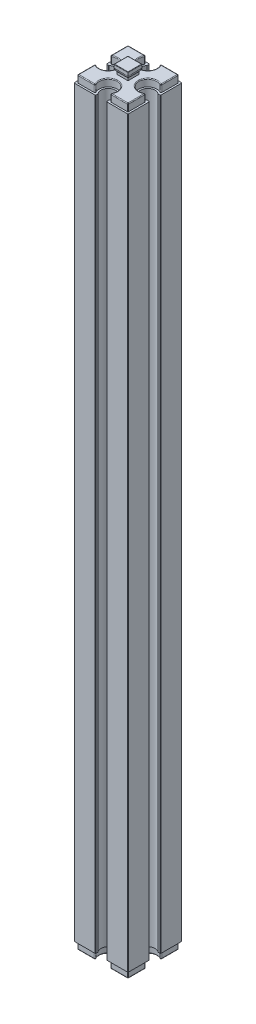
from build123d import *

# Parameters (mm, degrees)
EXTRUDE_1_DEPTH        = 103
EXTRUDE_2_DEPTH        = 2
EXTRUDE_3_DEPTH        = 2
FILLET_3_R             = 0.2
CUT_EXTRUDE_1_DEPTH    = 3
FILLET_4_R             = 0.2
FILLET_5_R             = 0.1
FILLET_3_OF_MIRROR_1_R = 0.2
FILLET_4_OF_MIRROR_1_R = 0.2
FILLET_5_OF_MIRROR_1_R = 0.1


with BuildPart() as part:
    # Sketch 1 → Extrude 1 (new body)
    with BuildSketch(Plane(origin=(0, 0, 0), x_dir=(1, 0, 0), z_dir=(0, 1, 0))):
        with BuildLine():
            Line((-7.5, 7.5), (-1.5, 7.5))
            Line((-1.5, 7.5), (-1.5, 6.822875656))
            ThreePointArc((-1.5, 6.822875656), (0, 3.5), (1.5, 6.822875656))
            Line((1.5, 6.822875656), (1.5, 7.5))
            Line((1.5, 7.5), (7.5, 7.5))
            Line((7.5, 7.5), (7.5, 1.5))
            Line((7.5, 1.5), (6.822875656, 1.5))
            ThreePointArc((6.822875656, 1.5), (3.5, 0), (6.822875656, -1.5))
            Line((6.822875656, -1.5), (7.5, -1.5))
            Line((7.5, -1.5), (7.5, -7.5))
            Line((7.5, -7.5), (1.5, -7.5))
            Line((1.5, -7.5), (1.5, -6.822875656))
            ThreePointArc((1.5, -6.822875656), (0, -3.5), (-1.5, -6.822875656))
            Line((-1.5, -6.822875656), (-1.5, -7.5))
            Line((-1.5, -7.5), (-7.5, -7.5))
            Line((-7.5, -7.5), (-7.5, -1.5))
            Line((-7.5, -1.5), (-6.822875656, -1.5))
            ThreePointArc((-6.822875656, -1.5), (-3.5, 0), (-6.822875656, 1.5))
            Line((-6.822875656, 1.5), (-7.5, 1.5))
            Line((-7.5, 1.5), (-7.5, 7.5))
        make_face()
    extrude_1 = extrude(amount=EXTRUDE_1_DEPTH)

    # Sketch 2 → Extrude 2 (add)
    with BuildSketch(Plane(origin=(0, 103, 0), x_dir=(1, 0, 0), z_dir=(0, 1, 0))):
        with BuildLine():
            Line((-7, 7), (-7, 2))
            ThreePointArc((-7, 2), (-3, 0), (-7, -2))
            Line((-7, -2), (-7, -7))
            Line((-7, -7), (-2, -7))
            ThreePointArc((-2, -7), (0, -3), (2, -7))
            Line((2, -7), (7, -7))
            Line((7, -7), (7, -2))
            ThreePointArc((7, -2), (3, 0), (7, 2))
            Line((7, 2), (7, 7))
            Line((7, 7), (2, 7))
            ThreePointArc((2, 7), (0, 3), (-2, 7))
            Line((-2, 7), (-7, 7))
        make_face()
    extrude_2 = extrude(amount=EXTRUDE_2_DEPTH)

    # Sketch 3 → Extrude 3 (add, symmetric)
    with BuildSketch(Plane(origin=(0, 0, 0), x_dir=(0, 0, -1), z_dir=(1, 0, 0))):
        with BuildLine():
            Line((-1.5, 105), (1.5, 105))
            Line((1.5, 105), (1.5, 105.677124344))
            ThreePointArc((1.5, 105.677124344), (1.780042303, 106.088161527), (1.95, 106.555590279))
            Line((1.95, 106.555590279), (1.95, 107.5))
            Line((1.95, 107.5), (-1.95, 107.5))
            Line((-1.95, 107.5), (-1.95, 106.555590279))
            ThreePointArc((-1.95, 106.555590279), (-1.780042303, 106.088161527), (-1.5, 105.677124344))
            Line((-1.5, 105.677124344), (-1.5, 105))
        make_face()
    extrude_3 = extrude(amount=EXTRUDE_3_DEPTH, both=True)

    # Fillet 3
    fillet_3_edges = [part.edges().sort_by_distance(p)[0] for p in [
        (-7.5, 51.5, -7.5),
        (-1.5, 51.5, -7.5),
        (1.5, 51.5, -7.5),
        (7.5, 51.5, -7.5),
        (7.5, 51.5, -1.5),
        (7.5, 51.5, 1.5),
        (7.5, 51.5, 7.5),
        (1.5, 51.5, 7.5),
        (-1.5, 51.5, 7.5),
        (-7.5, 51.5, 7.5),
        (-7.5, 51.5, 1.5),
        (-6.822875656, 51.5, -1.5),
        (-7.5, 51.5, -1.5),
    ]]
    fillet(fillet_3_edges, radius=FILLET_3_R)

    # Sketch 4 → Cut-Extrude 1 (cut, symmetric)
    with BuildSketch(Plane.XY):
        with BuildLine():
            Line((1.95, 107.5), (2, 107.5))
            Line((2, 107.5), (2, 105))
            Line((2, 105), (1.5, 105))
            Line((1.5, 105), (1.5, 105.677124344))
            ThreePointArc((1.5, 105.677124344), (1.780042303, 106.088161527), (1.95, 106.555590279))
            Line((1.95, 106.555590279), (1.95, 107.5))
        make_face()
        with BuildLine():
            Line((-1.95, 107.5), (-1.95, 106.555590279))
            ThreePointArc((-1.95, 106.555590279), (-1.780042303, 106.088161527), (-1.5, 105.677124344))
            Line((-1.5, 105.677124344), (-1.5, 105))
            Line((-1.5, 105), (-2, 105))
            Line((-2, 105), (-2, 107.5))
            Line((-2, 107.5), (-1.95, 107.5))
        make_face()
    cut_extrude_1 = extrude(amount=CUT_EXTRUDE_1_DEPTH, both=True, mode=Mode.SUBTRACT)

    # Fillet 4
    fillet_4_edges = [part.edges().sort_by_distance(p)[0] for p in [
        (-2, 104, -7),
        (-7, 104, -7),
        (-7, 104, -2),
        (-7, 104, 2),
        (-7, 104, 7),
        (-2, 104, 7),
        (2, 104, 7),
        (7, 104, 7),
        (7, 104, 2),
        (7, 104, -2),
        (7, 104, -7),
        (2, 104, -7),
        (-4.5, 105, -7),
        (-7, 105, -4.5),
        (-3, 105, 0),
        (-7, 105, 4.5),
        (-4.5, 105, 7),
        (0, 105, 3),
        (4.5, 105, 7),
        (7, 105, 4.5),
        (3, 105, 0),
        (7, 105, -4.5),
        (4.5, 105, -7),
        (0, 105, -3),
    ]]
    fillet(fillet_4_edges, radius=FILLET_4_R)

    # Fillet 5
    fillet_5_edges = [part.edges().sort_by_distance(p)[0] for p in [
        (1.95, 107.5, 0),
        (0, 107.5, -1.95),
        (0, 107.5, 1.95),
        (-1.95, 107.5, 0),
    ]]
    fillet(fillet_5_edges, radius=FILLET_5_R)

    # Mirror 1: Extrude 1, Extrude 2, Extrude 3, Cut-Extrude 1 across Top Plane
    add(extrude_1.mirror(Plane(origin=(0, 0, 0), x_dir=(1, 0, 0), z_dir=(0, 1, 0))))
    add(extrude_2.mirror(Plane(origin=(0, 0, 0), x_dir=(1, 0, 0), z_dir=(0, 1, 0))))
    add(extrude_3.mirror(Plane(origin=(0, 0, 0), x_dir=(1, 0, 0), z_dir=(0, 1, 0))))
    add(cut_extrude_1.mirror(Plane(origin=(0, 0, 0), x_dir=(1, 0, 0), z_dir=(0, 1, 0))), mode=Mode.SUBTRACT)

    # Fillet 3 of Mirror 1
    fillet_3_of_mirror_1_edges = [part.edges().sort_by_distance(p)[0] for p in [
        (-7.5, -51.5, -7.5),
        (-1.5, -51.5, -7.5),
        (1.5, -51.5, -7.5),
        (7.5, -51.5, -7.5),
        (7.5, -51.5, -1.5),
        (7.5, -51.5, 1.5),
        (7.5, -51.5, 7.5),
        (1.5, -51.5, 7.5),
        (-1.5, -51.5, 7.5),
        (-7.5, -51.5, 7.5),
        (-7.5, -51.5, 1.5),
        (-6.822875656, -51.5, -1.5),
        (-7.5, -51.5, -1.5),
    ]]
    fillet(fillet_3_of_mirror_1_edges, radius=FILLET_3_OF_MIRROR_1_R)

    # Fillet 4 of Mirror 1
    fillet_4_of_mirror_1_edges = [part.edges().sort_by_distance(p)[0] for p in [
        (-2, -104, -7),
        (-7, -104, -7),
        (-7, -104, -2),
        (-7, -104, 2),
        (-7, -104, 7),
        (-2, -104, 7),
        (2, -104, 7),
        (7, -104, 7),
        (7, -104, 2),
        (7, -104, -2),
        (7, -104, -7),
        (2, -104, -7),
        (-4.5, -105, -7),
        (-7, -105, -4.5),
        (-3, -105, 0),
        (-7, -105, 4.5),
        (-4.5, -105, 7),
        (0, -105, 3),
        (4.5, -105, 7),
        (7, -105, 4.5),
        (3, -105, 0),
        (7, -105, -4.5),
        (4.5, -105, -7),
        (0, -105, -3),
    ]]
    fillet(fillet_4_of_mirror_1_edges, radius=FILLET_4_OF_MIRROR_1_R)

    # Fillet 5 of Mirror 1
    fillet_5_of_mirror_1_edges = [part.edges().sort_by_distance(p)[0] for p in [
        (1.95, -107.5, 0),
        (0, -107.5, -1.95),
        (0, -107.5, 1.95),
        (-1.95, -107.5, 0),
    ]]
    fillet(fillet_5_of_mirror_1_edges, radius=FILLET_5_OF_MIRROR_1_R)


solid = part.part
